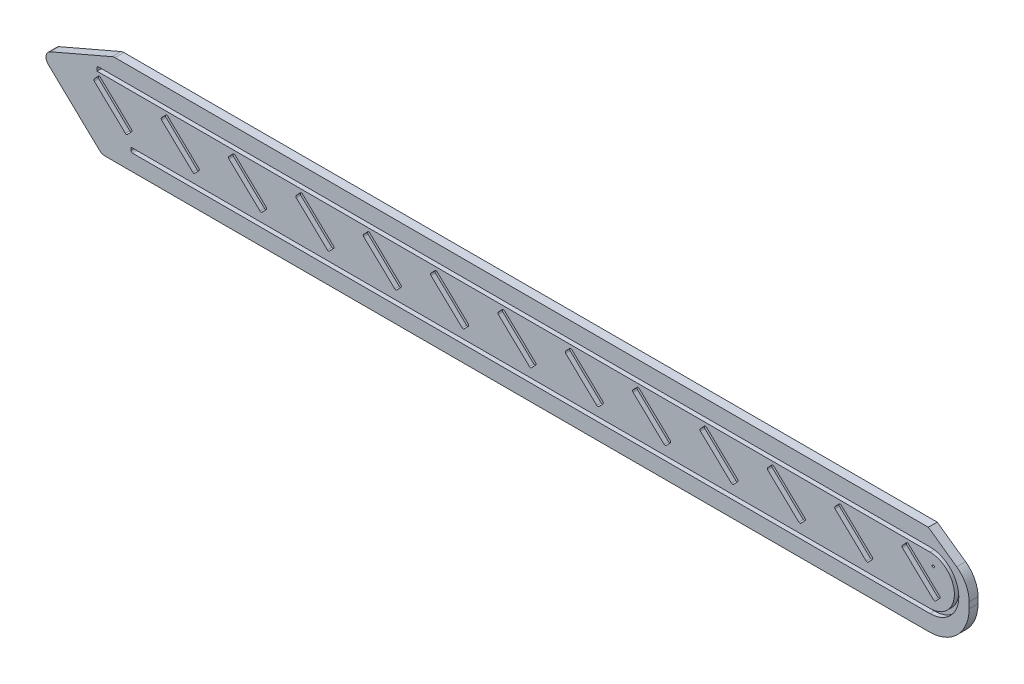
from build123d import *

# Parameters (mm, degrees)
SKETCH1_R                                       = 4
BOSS_EXTRUDE1_DEPTH                             = 15
BOSS_EXTRUDE2_START                             = -15
SKETCH1_11_R                                    = 4
BOSS_EXTRUDE2_DEPTH                             = 15
CSK_FOR_M5_FLAT_HEAD_MACHINE_SCREW2_D           = 5.5
CSK_FOR_M5_FLAT_HEAD_MACHINE_SCREW2_CSINK_D     = 10.4
CSK_FOR_M5_FLAT_HEAD_MACHINE_SCREW2_CSINK_ANGLE = 90
LPATTERN1_COUNT                                 = 13
LPATTERN1_PITCH                                 = 227.61
FILLET1_R                                       = 25
FILLET2_R                                       = 135


with BuildPart() as part:
    # Sketch1 → Boss-Extrude1 (new body)
    with BuildSketch(Plane.XY):
        with BuildLine():
            Line((-3018.475974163, -0.813661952), (-2810.071542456, -198.823390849))
            Line((-2810.071542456, -198.823390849), (121.07262217, -198.823390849))
            Line((121.07262217, -198.823390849), (121.07262217, -43.282571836))
            ThreePointArc((121.07262217, -43.282571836), (109.930228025, 2.590360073), (78.986104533, 38.240606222))
            Line((78.986104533, 38.240606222), (-16.645493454, 106.176609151))
            Line((-16.645493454, 106.176609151), (-2770.644242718, 106.176609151))
            Line((-2770.644242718, 106.176609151), (-3018.475974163, -0.813661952))
        make_face()
        Circle(SKETCH1_R, mode=Mode.SUBTRACT)
        with BuildLine():
            Line((-2495.825190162, -97.616720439), (-2482.049267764, -83.117618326))
            ThreePointArc((-2482.049267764, -83.117618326), (-2480.6756779, -79.545796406), (-2482.230062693, -76.048862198))
            Line((-2482.230062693, -76.048862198), (-2587.348553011, 23.826575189))
            ThreePointArc((-2587.348553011, 23.826575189), (-2590.920374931, 25.200165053), (-2594.417309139, 23.64578026))
            Line((-2594.417309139, 23.64578026), (-2608.193231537, 9.146678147))
            ThreePointArc((-2608.193231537, 9.146678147), (-2609.566821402, 5.574856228), (-2608.012436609, 2.07792202))
            Line((-2608.012436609, 2.07792202), (-2502.89394629, -97.797515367))
            ThreePointArc((-2502.89394629, -97.797515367), (-2499.322124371, -99.171105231), (-2495.825190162, -97.616720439))
        make_face(mode=Mode.SUBTRACT)
        with BuildLine():
            Line((-2711.247212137, -128.823390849), (-2711.247212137, -138.823390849))
            ThreePointArc((-2711.247212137, -138.823390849), (-2709.782746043, -142.358924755), (-2706.247212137, -143.823390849))
            Line((-2706.247212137, -143.823390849), (-11.247212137, -143.823390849))
            ThreePointArc((-11.247212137, -143.823390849), (86.252787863, -46.323390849), (-11.247212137, 51.176609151))
            Line((-11.247212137, 51.176609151), (-2821.247212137, 51.176609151))
            ThreePointArc((-2821.247212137, 51.176609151), (-2824.782746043, 49.712143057), (-2826.247212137, 46.176609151))
            Line((-2826.247212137, 46.176609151), (-2826.247212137, 36.176609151))
            Line((-2826.247212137, 36.176609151), (-11.247212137, 36.176609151))
            ThreePointArc((-11.247212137, 36.176609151), (71.252787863, -46.323390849), (-11.247212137, -128.823390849))
            Line((-11.247212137, -128.823390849), (-2711.247212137, -128.823390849))
        make_face(mode=Mode.SUBTRACT)
        with BuildLine():
            Line((-2268.215190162, -97.616720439), (-2254.439267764, -83.117618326))
            ThreePointArc((-2254.439267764, -83.117618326), (-2253.0656779, -79.545796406), (-2254.620062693, -76.048862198))
            Line((-2254.620062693, -76.048862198), (-2359.738553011, 23.826575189))
            ThreePointArc((-2359.738553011, 23.826575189), (-2363.310374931, 25.200165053), (-2366.807309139, 23.64578026))
            Line((-2366.807309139, 23.64578026), (-2380.583231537, 9.146678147))
            ThreePointArc((-2380.583231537, 9.146678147), (-2381.956821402, 5.574856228), (-2380.402436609, 2.07792202))
            Line((-2380.402436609, 2.07792202), (-2275.28394629, -97.797515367))
            ThreePointArc((-2275.28394629, -97.797515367), (-2271.712124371, -99.171105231), (-2268.215190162, -97.616720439))
        make_face(mode=Mode.SUBTRACT)
        with BuildLine():
            Line((-2040.605190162, -97.616720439), (-2026.829267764, -83.117618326))
            ThreePointArc((-2026.829267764, -83.117618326), (-2025.4556779, -79.545796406), (-2027.010062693, -76.048862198))
            Line((-2027.010062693, -76.048862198), (-2132.128553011, 23.826575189))
            ThreePointArc((-2132.128553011, 23.826575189), (-2135.700374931, 25.200165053), (-2139.197309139, 23.64578026))
            Line((-2139.197309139, 23.64578026), (-2152.973231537, 9.146678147))
            ThreePointArc((-2152.973231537, 9.146678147), (-2154.346821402, 5.574856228), (-2152.792436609, 2.07792202))
            Line((-2152.792436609, 2.07792202), (-2047.67394629, -97.797515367))
            ThreePointArc((-2047.67394629, -97.797515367), (-2044.102124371, -99.171105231), (-2040.605190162, -97.616720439))
        make_face(mode=Mode.SUBTRACT)
        with BuildLine():
            Line((-2723.435190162, -97.616720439), (-2709.659267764, -83.117618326))
            ThreePointArc((-2709.659267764, -83.117618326), (-2708.2856779, -79.545796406), (-2709.840062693, -76.048862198))
            Line((-2709.840062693, -76.048862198), (-2814.958553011, 23.826575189))
            ThreePointArc((-2814.958553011, 23.826575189), (-2818.530374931, 25.200165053), (-2822.027309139, 23.64578026))
            Line((-2822.027309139, 23.64578026), (-2835.803231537, 9.146678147))
            ThreePointArc((-2835.803231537, 9.146678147), (-2837.176821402, 5.574856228), (-2835.622436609, 2.07792202))
            Line((-2835.622436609, 2.07792202), (-2730.50394629, -97.797515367))
            ThreePointArc((-2730.50394629, -97.797515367), (-2726.932124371, -99.171105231), (-2723.435190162, -97.616720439))
        make_face(mode=Mode.SUBTRACT)
        with BuildLine():
            Line((-1812.995190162, -97.616720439), (-1799.219267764, -83.117618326))
            ThreePointArc((-1799.219267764, -83.117618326), (-1797.8456779, -79.545796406), (-1799.400062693, -76.048862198))
            Line((-1799.400062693, -76.048862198), (-1904.518553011, 23.826575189))
            ThreePointArc((-1904.518553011, 23.826575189), (-1908.090374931, 25.200165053), (-1911.587309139, 23.64578026))
            Line((-1911.587309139, 23.64578026), (-1925.363231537, 9.146678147))
            ThreePointArc((-1925.363231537, 9.146678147), (-1926.736821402, 5.574856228), (-1925.182436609, 2.07792202))
            Line((-1925.182436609, 2.07792202), (-1820.06394629, -97.797515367))
            ThreePointArc((-1820.06394629, -97.797515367), (-1816.492124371, -99.171105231), (-1812.995190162, -97.616720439))
        make_face(mode=Mode.SUBTRACT)
        with BuildLine():
            Line((-1585.385190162, -97.616720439), (-1571.609267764, -83.117618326))
            ThreePointArc((-1571.609267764, -83.117618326), (-1570.2356779, -79.545796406), (-1571.790062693, -76.048862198))
            Line((-1571.790062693, -76.048862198), (-1676.908553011, 23.826575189))
            ThreePointArc((-1676.908553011, 23.826575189), (-1680.480374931, 25.200165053), (-1683.977309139, 23.64578026))
            Line((-1683.977309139, 23.64578026), (-1697.753231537, 9.146678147))
            ThreePointArc((-1697.753231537, 9.146678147), (-1699.126821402, 5.574856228), (-1697.572436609, 2.07792202))
            Line((-1697.572436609, 2.07792202), (-1592.45394629, -97.797515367))
            ThreePointArc((-1592.45394629, -97.797515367), (-1588.882124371, -99.171105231), (-1585.385190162, -97.616720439))
        make_face(mode=Mode.SUBTRACT)
        with BuildLine():
            Line((-1357.775190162, -97.616720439), (-1343.999267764, -83.117618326))
            ThreePointArc((-1343.999267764, -83.117618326), (-1342.6256779, -79.545796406), (-1344.180062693, -76.048862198))
            Line((-1344.180062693, -76.048862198), (-1449.298553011, 23.826575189))
            ThreePointArc((-1449.298553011, 23.826575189), (-1452.870374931, 25.200165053), (-1456.367309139, 23.64578026))
            Line((-1456.367309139, 23.64578026), (-1470.143231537, 9.146678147))
            ThreePointArc((-1470.143231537, 9.146678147), (-1471.516821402, 5.574856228), (-1469.962436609, 2.07792202))
            Line((-1469.962436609, 2.07792202), (-1364.84394629, -97.797515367))
            ThreePointArc((-1364.84394629, -97.797515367), (-1361.272124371, -99.171105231), (-1357.775190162, -97.616720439))
        make_face(mode=Mode.SUBTRACT)
        with BuildLine():
            Line((-1130.165190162, -97.616720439), (-1116.389267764, -83.117618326))
            ThreePointArc((-1116.389267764, -83.117618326), (-1115.0156779, -79.545796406), (-1116.570062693, -76.048862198))
            Line((-1116.570062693, -76.048862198), (-1221.688553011, 23.826575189))
            ThreePointArc((-1221.688553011, 23.826575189), (-1225.260374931, 25.200165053), (-1228.757309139, 23.64578026))
            Line((-1228.757309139, 23.64578026), (-1242.533231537, 9.146678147))
            ThreePointArc((-1242.533231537, 9.146678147), (-1243.906821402, 5.574856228), (-1242.352436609, 2.07792202))
            Line((-1242.352436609, 2.07792202), (-1137.23394629, -97.797515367))
            ThreePointArc((-1137.23394629, -97.797515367), (-1133.662124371, -99.171105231), (-1130.165190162, -97.616720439))
        make_face(mode=Mode.SUBTRACT)
        with BuildLine():
            Line((-902.555190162, -97.616720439), (-888.779267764, -83.117618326))
            ThreePointArc((-888.779267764, -83.117618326), (-887.4056779, -79.545796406), (-888.960062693, -76.048862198))
            Line((-888.960062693, -76.048862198), (-994.078553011, 23.826575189))
            ThreePointArc((-994.078553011, 23.826575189), (-997.650374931, 25.200165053), (-1001.147309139, 23.64578026))
            Line((-1001.147309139, 23.64578026), (-1014.923231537, 9.146678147))
            ThreePointArc((-1014.923231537, 9.146678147), (-1016.296821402, 5.574856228), (-1014.742436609, 2.07792202))
            Line((-1014.742436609, 2.07792202), (-909.62394629, -97.797515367))
            ThreePointArc((-909.62394629, -97.797515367), (-906.052124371, -99.171105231), (-902.555190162, -97.616720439))
        make_face(mode=Mode.SUBTRACT)
        with BuildLine():
            Line((-674.945190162, -97.616720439), (-661.169267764, -83.117618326))
            ThreePointArc((-661.169267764, -83.117618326), (-659.7956779, -79.545796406), (-661.350062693, -76.048862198))
            Line((-661.350062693, -76.048862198), (-766.468553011, 23.826575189))
            ThreePointArc((-766.468553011, 23.826575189), (-770.040374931, 25.200165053), (-773.537309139, 23.64578026))
            Line((-773.537309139, 23.64578026), (-787.313231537, 9.146678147))
            ThreePointArc((-787.313231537, 9.146678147), (-788.686821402, 5.574856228), (-787.132436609, 2.07792202))
            Line((-787.132436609, 2.07792202), (-682.01394629, -97.797515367))
            ThreePointArc((-682.01394629, -97.797515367), (-678.442124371, -99.171105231), (-674.945190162, -97.616720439))
        make_face(mode=Mode.SUBTRACT)
        with BuildLine():
            Line((-447.335190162, -97.616720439), (-433.559267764, -83.117618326))
            ThreePointArc((-433.559267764, -83.117618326), (-432.1856779, -79.545796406), (-433.740062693, -76.048862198))
            Line((-433.740062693, -76.048862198), (-538.858553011, 23.826575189))
            ThreePointArc((-538.858553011, 23.826575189), (-542.430374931, 25.200165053), (-545.927309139, 23.64578026))
            Line((-545.927309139, 23.64578026), (-559.703231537, 9.146678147))
            ThreePointArc((-559.703231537, 9.146678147), (-561.076821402, 5.574856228), (-559.522436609, 2.07792202))
            Line((-559.522436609, 2.07792202), (-454.40394629, -97.797515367))
            ThreePointArc((-454.40394629, -97.797515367), (-450.832124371, -99.171105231), (-447.335190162, -97.616720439))
        make_face(mode=Mode.SUBTRACT)
        with BuildLine():
            Line((-219.725190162, -97.616720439), (-205.949267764, -83.117618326))
            ThreePointArc((-205.949267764, -83.117618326), (-204.5756779, -79.545796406), (-206.130062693, -76.048862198))
            Line((-206.130062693, -76.048862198), (-311.248553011, 23.826575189))
            ThreePointArc((-311.248553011, 23.826575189), (-314.820374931, 25.200165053), (-318.317309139, 23.64578026))
            Line((-318.317309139, 23.64578026), (-332.093231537, 9.146678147))
            ThreePointArc((-332.093231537, 9.146678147), (-333.466821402, 5.574856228), (-331.912436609, 2.07792202))
            Line((-331.912436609, 2.07792202), (-226.79394629, -97.797515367))
            ThreePointArc((-226.79394629, -97.797515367), (-223.222124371, -99.171105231), (-219.725190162, -97.616720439))
        make_face(mode=Mode.SUBTRACT)
        with BuildLine():
            Line((7.884809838, -97.616720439), (21.660732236, -83.117618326))
            ThreePointArc((21.660732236, -83.117618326), (23.0343221, -79.545796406), (21.479937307, -76.048862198))
            Line((21.479937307, -76.048862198), (-83.638553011, 23.826575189))
            ThreePointArc((-83.638553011, 23.826575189), (-87.210374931, 25.200165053), (-90.707309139, 23.64578026))
            Line((-90.707309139, 23.64578026), (-104.483231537, 9.146678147))
            ThreePointArc((-104.483231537, 9.146678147), (-105.856821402, 5.574856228), (-104.302436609, 2.07792202))
            Line((-104.302436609, 2.07792202), (0.81605371, -97.797515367))
            ThreePointArc((0.81605371, -97.797515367), (4.387875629, -99.171105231), (7.884809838, -97.616720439))
        make_face(mode=Mode.SUBTRACT)
    extrude(amount=BOSS_EXTRUDE1_DEPTH)

    # Sketch1_11 → Boss-Extrude2 (add)
    with BuildSketch(Plane.XY.offset(BOSS_EXTRUDE2_START)):
        with BuildLine():
            Line((-3018.475974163, -0.813661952), (-2810.071542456, -198.823390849))
            Line((-2810.071542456, -198.823390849), (121.07262217, -198.823390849))
            Line((121.07262217, -198.823390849), (121.07262217, -43.282571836))
            ThreePointArc((121.07262217, -43.282571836), (109.930228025, 2.590360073), (78.986104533, 38.240606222))
            Line((78.986104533, 38.240606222), (-16.645493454, 106.176609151))
            Line((-16.645493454, 106.176609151), (-2770.644242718, 106.176609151))
            Line((-2770.644242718, 106.176609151), (-3018.475974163, -0.813661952))
        make_face()
        Circle(SKETCH1_11_R, mode=Mode.SUBTRACT)
    extrude(amount=BOSS_EXTRUDE2_DEPTH)

    # CSK for M5 Flat Head Machine Screw2 (through all)
    with Locations(Plane(origin=(0, 0, -15), x_dir=(-1, 0, 0), z_dir=(0, 0, -1))):
        with Locations((2772.731249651, -36.985470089)):
            csk_for_m5_flat_head_machine_screw2 = CounterSinkHole(CSK_FOR_M5_FLAT_HEAD_MACHINE_SCREW2_D / 2, CSK_FOR_M5_FLAT_HEAD_MACHINE_SCREW2_CSINK_D / 2, counter_sink_angle=CSK_FOR_M5_FLAT_HEAD_MACHINE_SCREW2_CSINK_ANGLE)

    # LPattern1: CSK for M5 Flat Head Machine Screw2 ×13
    with Locations(*[(i * LPATTERN1_PITCH, 0, 0) for i in range(1, LPATTERN1_COUNT)]):
        add(csk_for_m5_flat_head_machine_screw2, mode=Mode.SUBTRACT)

    # Fillet1
    fillet1_edges = [part.edges().sort_by_distance(p)[0] for p in [
        (-2810.071542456, -198.823390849, 0),
        (-3018.475974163, -0.813661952, 0),
        (-2770.644242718, 106.176609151, 0),
    ]]
    fillet(fillet1_edges, radius=FILLET1_R)

    # Fillet2
    fillet2_edges = [part.edges().sort_by_distance(p)[0] for p in [
        (121.07262217, -198.823390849, 0),
    ]]
    fillet(fillet2_edges, radius=FILLET2_R)


solid = part.part
